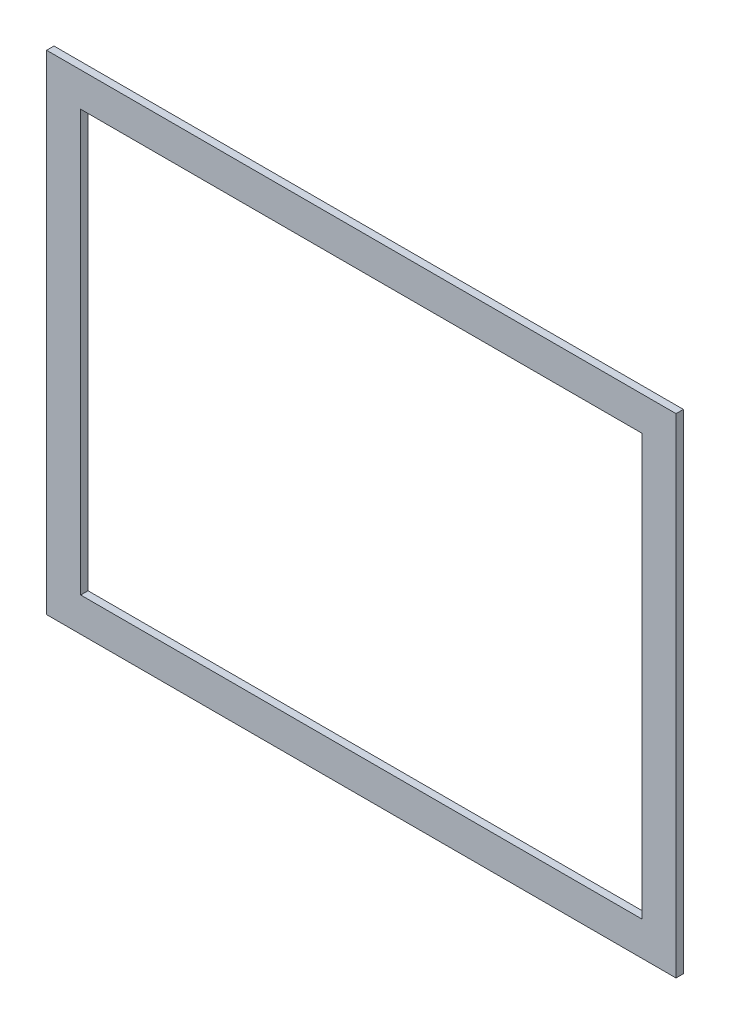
from build123d import *

# Parameters (mm, degrees)
ESQUISSE1_W        = 55.5
ESQUISSE1_H        = 43.1
ESQUISSE1_W_2      = 49.5
ESQUISSE1_H_2      = 37.1
BOSS_EXTRU_1_DEPTH = 0.65


with BuildPart() as part:
    # Esquisse1 → Boss.-Extru.1 (new body)
    with BuildSketch(Plane.XY):
        with Locations((-2.45, 36.84)):
            Rectangle(ESQUISSE1_W, ESQUISSE1_H)
        with Locations((-2.45, 36.84)):
            Rectangle(ESQUISSE1_W_2, ESQUISSE1_H_2, mode=Mode.SUBTRACT)
    extrude(amount=BOSS_EXTRU_1_DEPTH)


solid = part.part
